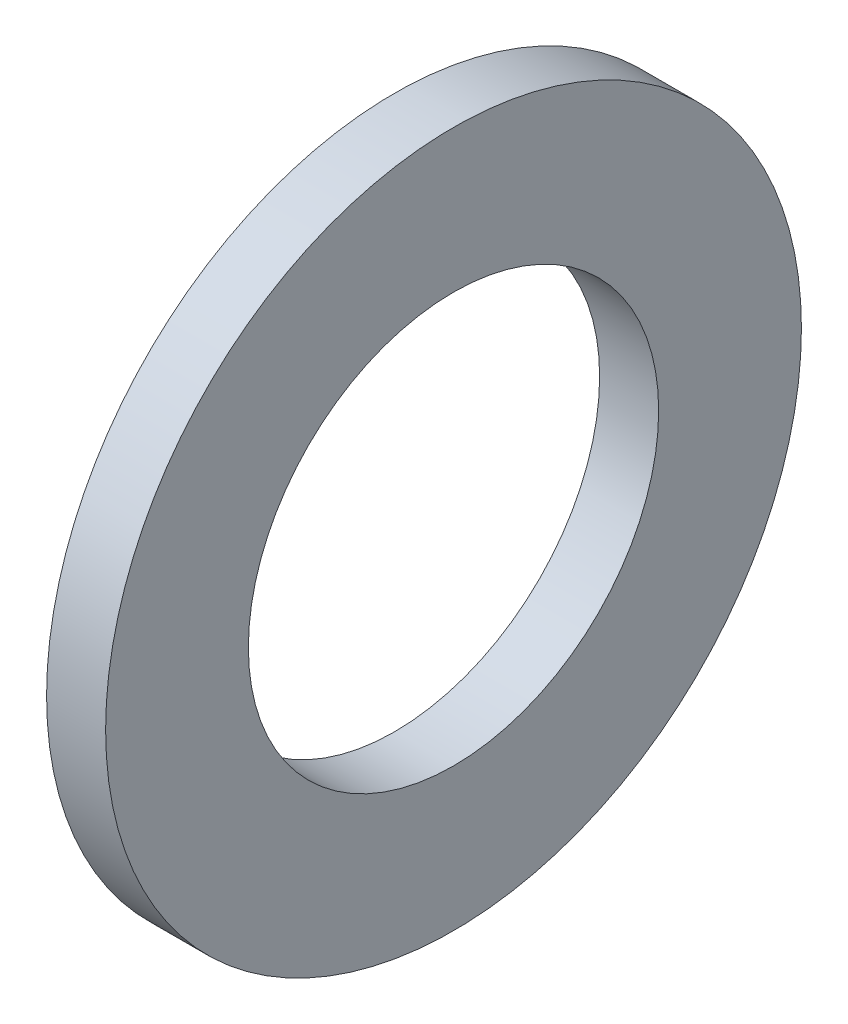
from build123d import *

# Parameters (mm, degrees)
SKETCH1_W = 5.6
SKETCH1_H = 13.54


with BuildPart() as part:
    # Sketch1 → Base-Revolve (revolve)
    with BuildSketch(Plane.XY, mode=Mode.PRIVATE) as base_revolve_sk:
        with Locations((-2.8, 26.23)):
            Rectangle(SKETCH1_W, SKETCH1_H)
    revolve(base_revolve_sk.sketch.rotate(Axis((-34.925, 0, 0), (1, 0, 0)), 90), axis=Axis((-34.925, 0, 0), (1, 0, 0)))


solid = part.part
